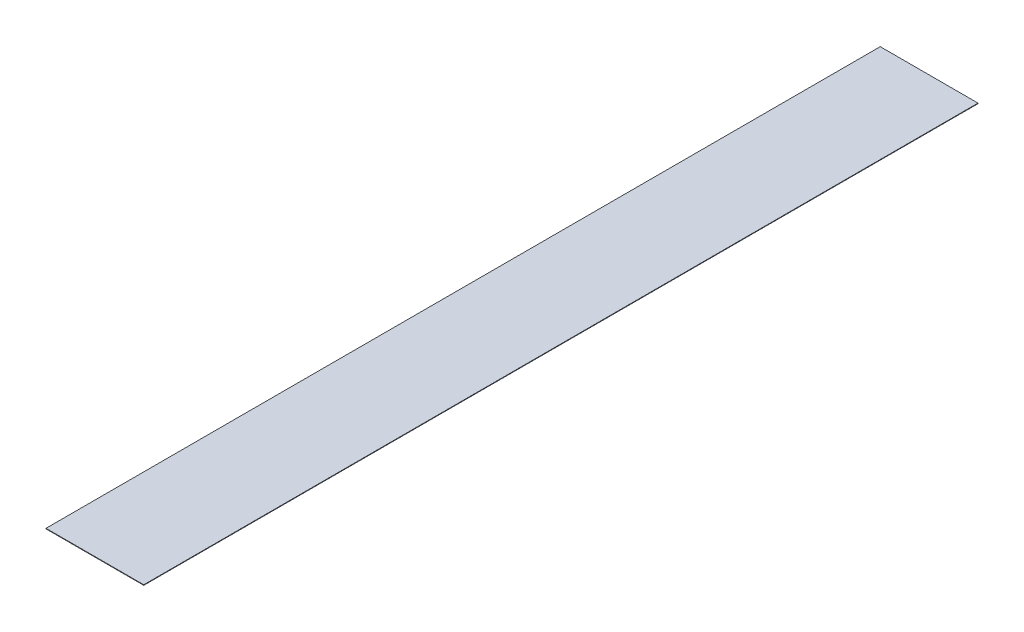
from build123d import *

# Parameters (mm, degrees)
SKETCH1_W           = 47.625
SKETCH1_H           = 406.4
BOSS_EXTRUDE1_DEPTH = 0.254


with BuildPart() as part:
    # Sketch1 → Boss-Extrude1 (new body)
    with BuildSketch(Plane(origin=(0, 0, 0), x_dir=(1, 0, 0), z_dir=(0, 1, 0))):
        Rectangle(SKETCH1_W, SKETCH1_H)
    extrude(amount=BOSS_EXTRUDE1_DEPTH)


solid = part.part
